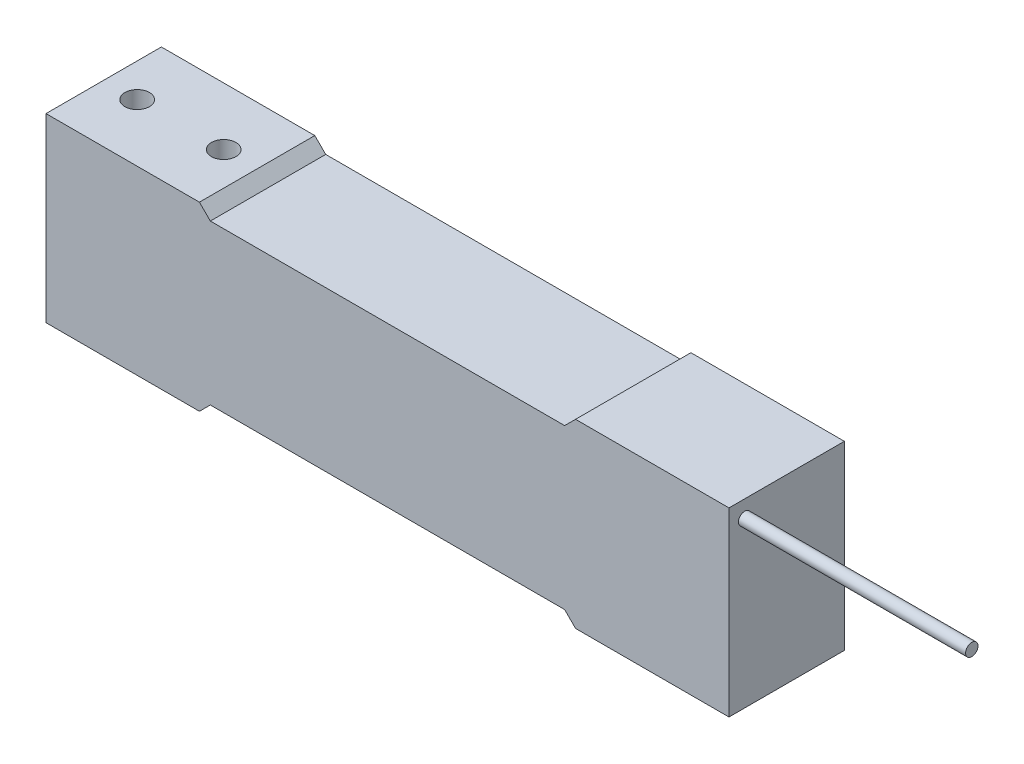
from build123d import *

# Parameters (mm, degrees)
SKETCH1_W      = 150.368
SKETCH1_H      = 25.4
EXTRUDE1_DEPTH = 19.939
EXTRUDE2_DEPTH = 82.825164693
SKETCH10_R     = 1.36770933
EXTRUDE4_DEPTH = 50


with BuildPart() as part:
    # Sketch1 → Extrude1 (new, symmetric)
    with BuildSketch(Plane(origin=(0, 0, 0), x_dir=(1, 0, 0), z_dir=(0, 1, 0))):
        Rectangle(SKETCH1_W, SKETCH1_H)
    extrude(amount=EXTRUDE1_DEPTH, both=True)

    # Sketch3 → Extrude2 (cut, through all)
    with BuildSketch(Plane.XY.offset(12.7)):
        Polygon((-39.002, 17.539), (39.002, 17.539), (41.402, 19.939), (-41.402, 19.939), align=None)
    extrude2 = extrude(amount=-EXTRUDE2_DEPTH, mode=Mode.SUBTRACT)

    # Sketch7 → 1_4-28 Tapped Hole2 (revolve, cut)
    with BuildSketch(Plane(origin=(-67.818, 19.939, 0), x_dir=(0, 0, 1), z_dir=(1, 0, 0))):
        Polygon((0, 0), (0, 12.801388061), (2.7051, 11.176), (2.7051, 0), align=None)
    f_1_4_28_tapped_hole2 = revolve(axis=Axis((-67.818, 26.289, 0), (0, -1, 0)), mode=Mode.SUBTRACT)

    # Mirror3: 1_4-28 Tapped Hole2 across plane
    add(f_1_4_28_tapped_hole2.mirror(Plane(origin=(-58.293, 0, 0), x_dir=(0, 0, 1), z_dir=(1, 0, 0))), mode=Mode.SUBTRACT)

    # Mirror4: Extrude2 across plane
    add(extrude2.mirror(Plane.ZX), mode=Mode.SUBTRACT)

    # Sketch9 → 1_4-28 Tapped Hole3 (revolve, cut)
    with BuildSketch(Plane(origin=(48.768, -19.939, 0), x_dir=(0, 0, -1), z_dir=(1, 0, 0))):
        Polygon((0, 0), (0, 12.801388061), (2.7051, 11.176), (2.7051, 0), align=None)
    f_1_4_28_tapped_hole3 = revolve(axis=Axis((48.768, -26.289, 0), (0, 1, 0)), mode=Mode.SUBTRACT)

    # Mirror6: 1_4-28 Tapped Hole3 across plane
    add(f_1_4_28_tapped_hole3.mirror(Plane(origin=(58.293, 0, 0), x_dir=(0, 0, 1), z_dir=(1, 0, 0))), mode=Mode.SUBTRACT)

    # Sketch10 → Extrude4 (add)
    with BuildSketch(Plane(origin=(75.184, 0, 0), x_dir=(0, 0, -1), z_dir=(1, 0, 0))):
        with Locations(Location((-9.244520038, 16.207924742, 0), (0, 0, 180))):
            Circle(SKETCH10_R)
    extrude(amount=EXTRUDE4_DEPTH)


solid = part.part
